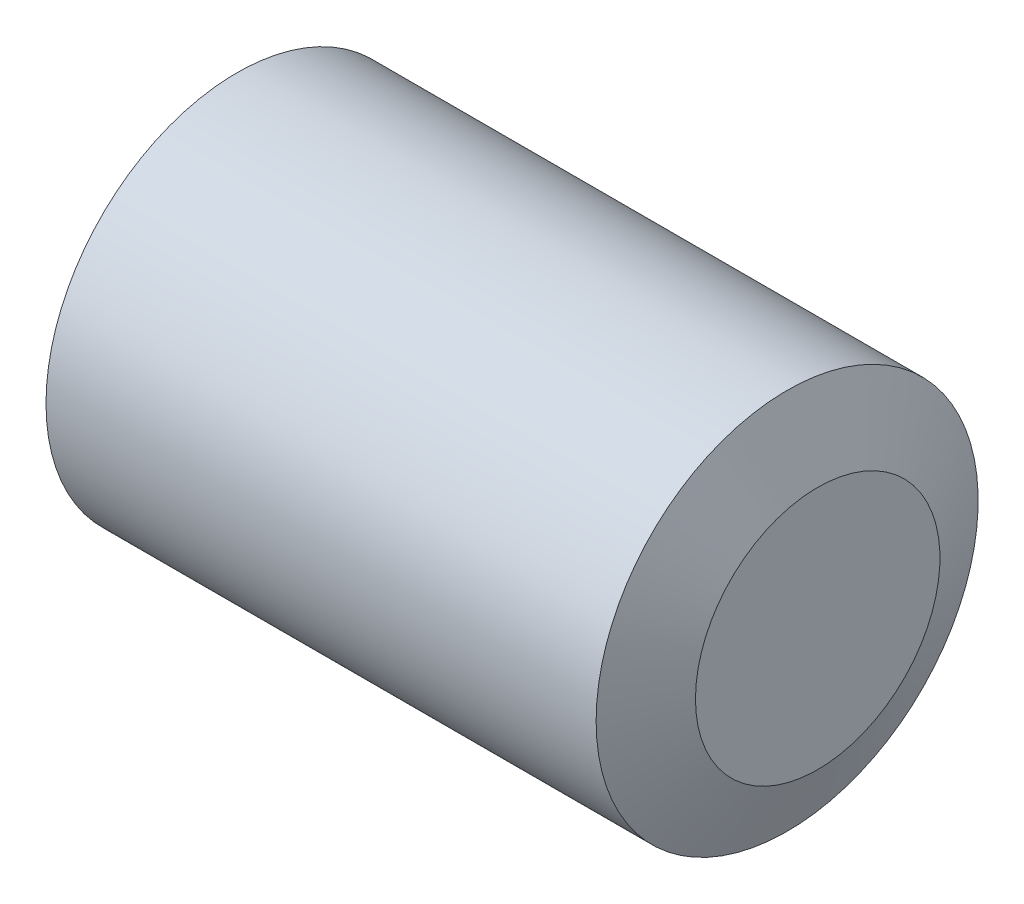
ISO-10303-21;
HEADER;
FILE_DESCRIPTION(('STEP AP214'),'2;1');
FILE_NAME('part.step','',(''),(''),'','','');
FILE_SCHEMA(('AUTOMOTIVE_DESIGN { 1 0 10303 214 1 1 1 1 }'));
ENDSEC;
DATA;
#1=APPLICATION_CONTEXT('core data for automotive mechanical design processes');
#2=APPLICATION_PROTOCOL_DEFINITION('international standard','automotive_design',2000,#1);
#3=PRODUCT_CONTEXT('',#1,'mechanical');
#4=PRODUCT('Part','Part','',(#3));
#5=PRODUCT_RELATED_PRODUCT_CATEGORY('part','',(#4));
#6=PRODUCT_DEFINITION_FORMATION('','',#4);
#7=PRODUCT_DEFINITION_CONTEXT('part definition',#1,'design');
#8=PRODUCT_DEFINITION('design','',#6,#7);
#9=PRODUCT_DEFINITION_SHAPE('','',#8);
#10=(LENGTH_UNIT() NAMED_UNIT(*) SI_UNIT(.MILLI.,.METRE.));
#11=(NAMED_UNIT(*) PLANE_ANGLE_UNIT() SI_UNIT($,.RADIAN.));
#12=(NAMED_UNIT(*) SI_UNIT($,.STERADIAN.) SOLID_ANGLE_UNIT());
#13=UNCERTAINTY_MEASURE_WITH_UNIT(LENGTH_MEASURE(1.E-05),#10,'distance_accuracy_value','');
#14=(GEOMETRIC_REPRESENTATION_CONTEXT(3) GLOBAL_UNCERTAINTY_ASSIGNED_CONTEXT((#13)) GLOBAL_UNIT_ASSIGNED_CONTEXT((#10,
#11,#12)) REPRESENTATION_CONTEXT('',''));
#15=CARTESIAN_POINT('',(0.,0.,0.));
#16=DIRECTION('',(0.,0.,1.));
#17=DIRECTION('',(1.,0.,0.));
#18=AXIS2_PLACEMENT_3D('',#15,#16,#17);
#19=CARTESIAN_POINT('',(20.,8.,0.));
#20=DIRECTION('',(-1.,0.,0.));
#21=DIRECTION('',(0.,0.,1.));
#22=AXIS2_PLACEMENT_3D('',#19,#20,#21);
#23=PLANE('',#22);
#24=CARTESIAN_POINT('',(20.,0.,0.));
#25=DIRECTION('',(-1.,0.,0.));
#26=DIRECTION('',(0.,0.,1.));
#27=AXIS2_PLACEMENT_3D('',#24,#25,#26);
#28=CIRCLE('',#27,8.);
#29=CARTESIAN_POINT('',(20.,0.,8.));
#30=VERTEX_POINT('',#29);
#31=EDGE_CURVE('E18',#30,#30,#28,.T.);
#32=ORIENTED_EDGE('',*,*,#31,.F.);
#33=EDGE_LOOP('',(#32));
#34=FACE_BOUND('',#33,.T.);
#35=ADVANCED_FACE('F15',(#34),#23,.F.);
#36=CARTESIAN_POINT('',(-20.,0.,0.));
#37=DIRECTION('',(1.,0.,0.));
#38=DIRECTION('',(0.,0.,-1.));
#39=AXIS2_PLACEMENT_3D('',#36,#37,#38);
#40=PLANE('',#39);
#41=CARTESIAN_POINT('',(-20.,0.,0.));
#42=DIRECTION('',(1.,0.,0.));
#43=DIRECTION('',(0.,0.,-1.));
#44=AXIS2_PLACEMENT_3D('',#41,#42,#43);
#45=CIRCLE('',#44,8.);
#46=CARTESIAN_POINT('',(-20.,0.,-8.));
#47=VERTEX_POINT('',#46);
#48=EDGE_CURVE('E27',#47,#47,#45,.T.);
#49=ORIENTED_EDGE('',*,*,#48,.F.);
#50=EDGE_LOOP('',(#49));
#51=FACE_BOUND('',#50,.T.);
#52=ADVANCED_FACE('F38',(#51),#40,.F.);
#53=CARTESIAN_POINT('',(18.,0.,0.));
#54=DIRECTION('',(-1.,0.,0.));
#55=DIRECTION('',(0.,0.,1.));
#56=AXIS2_PLACEMENT_3D('',#53,#54,#55);
#57=CONICAL_SURFACE('',#56,12.5,1.15257199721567);
#58=CARTESIAN_POINT('',(18.,0.,0.));
#59=DIRECTION('',(-1.,0.,0.));
#60=DIRECTION('',(0.,0.,1.));
#61=AXIS2_PLACEMENT_3D('',#58,#59,#60);
#62=CIRCLE('',#61,12.5);
#63=CARTESIAN_POINT('',(18.,0.,12.5));
#64=VERTEX_POINT('',#63);
#65=EDGE_CURVE('E22',#64,#64,#62,.T.);
#66=ORIENTED_EDGE('',*,*,#65,.F.);
#67=EDGE_LOOP('',(#66));
#68=FACE_BOUND('',#67,.T.);
#69=ORIENTED_EDGE('',*,*,#31,.T.);
#70=EDGE_LOOP('',(#69));
#71=FACE_BOUND('',#70,.T.);
#72=ADVANCED_FACE('F35',(#68,#71),#57,.T.);
#73=CARTESIAN_POINT('',(-18.,0.,0.));
#74=DIRECTION('',(1.,0.,0.));
#75=DIRECTION('',(0.,0.,-1.));
#76=AXIS2_PLACEMENT_3D('',#73,#74,#75);
#77=CONICAL_SURFACE('',#76,12.5,1.15257199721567);
#78=CARTESIAN_POINT('',(-18.,0.,0.));
#79=DIRECTION('',(-1.,0.,0.));
#80=DIRECTION('',(0.,0.,1.));
#81=AXIS2_PLACEMENT_3D('',#78,#79,#80);
#82=CIRCLE('',#81,12.5);
#83=CARTESIAN_POINT('',(-18.,0.,12.5));
#84=VERTEX_POINT('',#83);
#85=EDGE_CURVE('E10',#84,#84,#82,.F.);
#86=ORIENTED_EDGE('',*,*,#85,.F.);
#87=EDGE_LOOP('',(#86));
#88=FACE_BOUND('',#87,.T.);
#89=ORIENTED_EDGE('',*,*,#48,.T.);
#90=EDGE_LOOP('',(#89));
#91=FACE_BOUND('',#90,.T.);
#92=ADVANCED_FACE('F46',(#88,#91),#77,.T.);
#93=CARTESIAN_POINT('',(20.,0.,0.));
#94=DIRECTION('',(-1.,0.,0.));
#95=DIRECTION('',(0.,0.,1.));
#96=AXIS2_PLACEMENT_3D('',#93,#94,#95);
#97=CYLINDRICAL_SURFACE('',#96,12.5);
#98=ORIENTED_EDGE('',*,*,#85,.T.);
#99=EDGE_LOOP('',(#98));
#100=FACE_BOUND('',#99,.T.);
#101=ORIENTED_EDGE('',*,*,#65,.T.);
#102=EDGE_LOOP('',(#101));
#103=FACE_BOUND('',#102,.T.);
#104=ADVANCED_FACE('F44',(#100,#103),#97,.T.);
#105=CLOSED_SHELL('',(#35,#52,#72,#92,#104));
#106=MANIFOLD_SOLID_BREP('B1',#105);
#107=ADVANCED_BREP_SHAPE_REPRESENTATION('',(#18,#106),#14);
#108=SHAPE_DEFINITION_REPRESENTATION(#9,#107);
ENDSEC;
END-ISO-10303-21;
